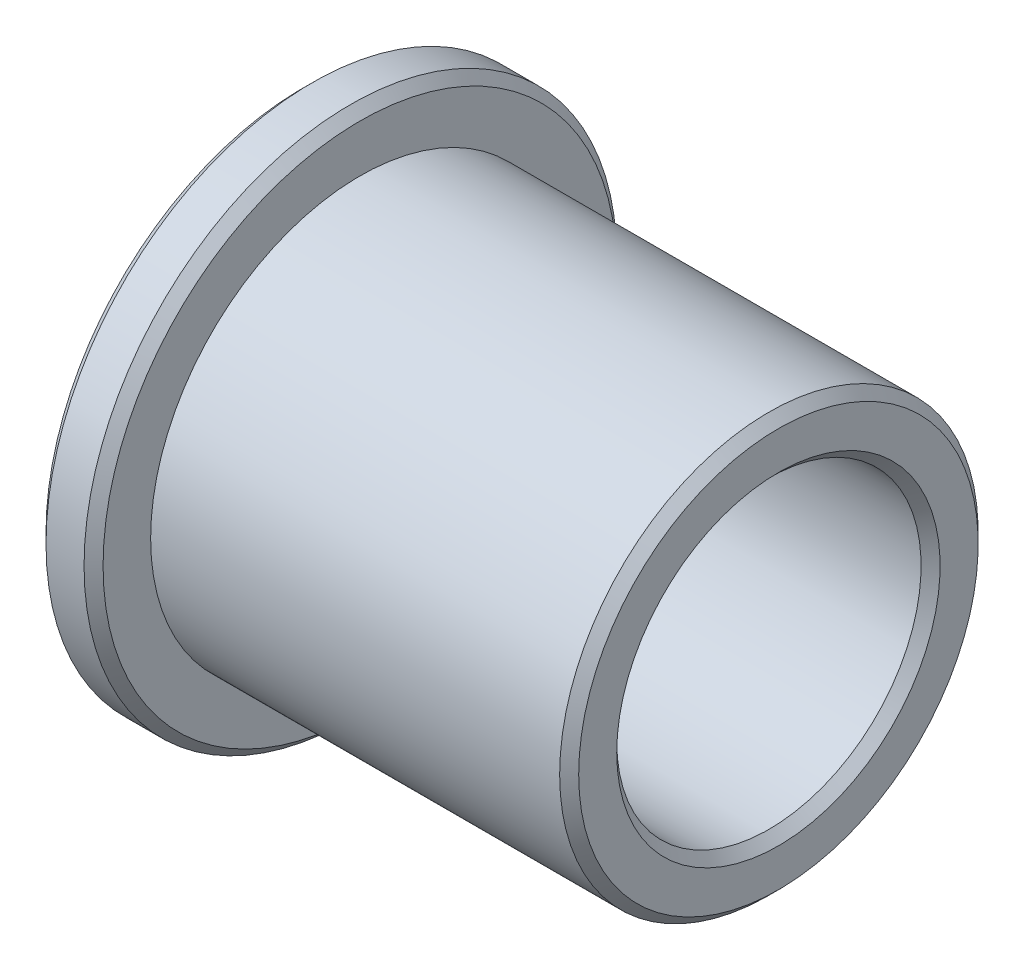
ISO-10303-21;
HEADER;
FILE_DESCRIPTION(('STEP AP214'),'2;1');
FILE_NAME('part.step','',(''),(''),'','','');
FILE_SCHEMA(('AUTOMOTIVE_DESIGN { 1 0 10303 214 1 1 1 1 }'));
ENDSEC;
DATA;
#1=APPLICATION_CONTEXT('core data for automotive mechanical design processes');
#2=APPLICATION_PROTOCOL_DEFINITION('international standard','automotive_design',2000,#1);
#3=PRODUCT_CONTEXT('',#1,'mechanical');
#4=PRODUCT('Part','Part','',(#3));
#5=PRODUCT_RELATED_PRODUCT_CATEGORY('part','',(#4));
#6=PRODUCT_DEFINITION_FORMATION('','',#4);
#7=PRODUCT_DEFINITION_CONTEXT('part definition',#1,'design');
#8=PRODUCT_DEFINITION('design','',#6,#7);
#9=PRODUCT_DEFINITION_SHAPE('','',#8);
#10=(LENGTH_UNIT() NAMED_UNIT(*) SI_UNIT(.MILLI.,.METRE.));
#11=(NAMED_UNIT(*) PLANE_ANGLE_UNIT() SI_UNIT($,.RADIAN.));
#12=(NAMED_UNIT(*) SI_UNIT($,.STERADIAN.) SOLID_ANGLE_UNIT());
#13=UNCERTAINTY_MEASURE_WITH_UNIT(LENGTH_MEASURE(1.E-05),#10,'distance_accuracy_value','');
#14=(GEOMETRIC_REPRESENTATION_CONTEXT(3) GLOBAL_UNCERTAINTY_ASSIGNED_CONTEXT((#13)) GLOBAL_UNIT_ASSIGNED_CONTEXT((#10,
#11,#12)) REPRESENTATION_CONTEXT('',''));
#15=CARTESIAN_POINT('',(0.,0.,0.));
#16=DIRECTION('',(0.,0.,1.));
#17=DIRECTION('',(1.,0.,0.));
#18=AXIS2_PLACEMENT_3D('',#15,#16,#17);
#19=CARTESIAN_POINT('',(-31.662967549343,0.,0.));
#20=DIRECTION('',(-1.,0.,0.));
#21=DIRECTION('',(0.,0.,1.));
#22=AXIS2_PLACEMENT_3D('',#19,#20,#21);
#23=CYLINDRICAL_SURFACE('',#22,11.);
#24=CARTESIAN_POINT('',(3.,0.,0.));
#25=DIRECTION('',(-1.,0.,0.));
#26=DIRECTION('',(0.,0.,1.));
#27=AXIS2_PLACEMENT_3D('',#24,#25,#26);
#28=CIRCLE('',#27,11.);
#29=CARTESIAN_POINT('',(3.,0.,11.));
#30=VERTEX_POINT('',#29);
#31=EDGE_CURVE('E66',#30,#30,#28,.T.);
#32=ORIENTED_EDGE('',*,*,#31,.F.);
#33=EDGE_LOOP('',(#32));
#34=FACE_BOUND('',#33,.T.);
#35=CARTESIAN_POINT('',(24.5,0.,0.));
#36=DIRECTION('',(-1.,0.,0.));
#37=DIRECTION('',(0.,0.,1.));
#38=AXIS2_PLACEMENT_3D('',#35,#36,#37);
#39=CIRCLE('',#38,11.);
#40=CARTESIAN_POINT('',(24.5,0.,11.));
#41=VERTEX_POINT('',#40);
#42=EDGE_CURVE('E10',#41,#41,#39,.T.);
#43=ORIENTED_EDGE('',*,*,#42,.T.);
#44=EDGE_LOOP('',(#43));
#45=FACE_BOUND('',#44,.T.);
#46=ADVANCED_FACE('F29',(#34,#45),#23,.T.);
#47=CARTESIAN_POINT('',(25.,0.,0.));
#48=DIRECTION('',(-1.,0.,0.));
#49=DIRECTION('',(0.,0.,1.));
#50=AXIS2_PLACEMENT_3D('',#47,#48,#49);
#51=CONICAL_SURFACE('',#50,10.5,0.785398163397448);
#52=ORIENTED_EDGE('',*,*,#42,.F.);
#53=EDGE_LOOP('',(#52));
#54=FACE_BOUND('',#53,.T.);
#55=CARTESIAN_POINT('',(25.,0.,0.));
#56=DIRECTION('',(-1.,0.,0.));
#57=DIRECTION('',(0.,0.,1.));
#58=AXIS2_PLACEMENT_3D('',#55,#56,#57);
#59=CIRCLE('',#58,10.5);
#60=CARTESIAN_POINT('',(25.,0.,10.5));
#61=VERTEX_POINT('',#60);
#62=EDGE_CURVE('E35',#61,#61,#59,.T.);
#63=ORIENTED_EDGE('',*,*,#62,.T.);
#64=EDGE_LOOP('',(#63));
#65=FACE_BOUND('',#64,.T.);
#66=ADVANCED_FACE('F73',(#54,#65),#51,.T.);
#67=CARTESIAN_POINT('',(25.0000000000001,10.5,0.));
#68=DIRECTION('',(-1.,0.,0.));
#69=DIRECTION('',(0.,0.,1.));
#70=AXIS2_PLACEMENT_3D('',#67,#68,#69);
#71=PLANE('',#70);
#72=ORIENTED_EDGE('',*,*,#62,.F.);
#73=EDGE_LOOP('',(#72));
#74=FACE_BOUND('',#73,.T.);
#75=CARTESIAN_POINT('',(25.,0.,0.));
#76=DIRECTION('',(-1.,0.,0.));
#77=DIRECTION('',(0.,0.,1.));
#78=AXIS2_PLACEMENT_3D('',#75,#76,#77);
#79=CIRCLE('',#78,8.5);
#80=CARTESIAN_POINT('',(25.,0.,8.5));
#81=VERTEX_POINT('',#80);
#82=EDGE_CURVE('E39',#81,#81,#79,.T.);
#83=ORIENTED_EDGE('',*,*,#82,.T.);
#84=EDGE_LOOP('',(#83));
#85=FACE_BOUND('',#84,.T.);
#86=ADVANCED_FACE('F77',(#74,#85),#71,.F.);
#87=CARTESIAN_POINT('',(24.5,0.,0.));
#88=DIRECTION('',(1.,0.,0.));
#89=DIRECTION('',(0.,0.,-1.));
#90=AXIS2_PLACEMENT_3D('',#87,#88,#89);
#91=CONICAL_SURFACE('',#90,8.,0.785398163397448);
#92=ORIENTED_EDGE('',*,*,#82,.F.);
#93=EDGE_LOOP('',(#92));
#94=FACE_BOUND('',#93,.T.);
#95=CARTESIAN_POINT('',(24.5,0.,0.));
#96=DIRECTION('',(-1.,0.,0.));
#97=DIRECTION('',(0.,0.,1.));
#98=AXIS2_PLACEMENT_3D('',#95,#96,#97);
#99=CIRCLE('',#98,8.);
#100=CARTESIAN_POINT('',(24.5,0.,8.));
#101=VERTEX_POINT('',#100);
#102=EDGE_CURVE('E43',#101,#101,#99,.T.);
#103=ORIENTED_EDGE('',*,*,#102,.T.);
#104=EDGE_LOOP('',(#103));
#105=FACE_BOUND('',#104,.T.);
#106=ADVANCED_FACE('F82',(#94,#105),#91,.F.);
#107=CARTESIAN_POINT('',(-31.662967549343,0.,0.));
#108=DIRECTION('',(-1.,0.,0.));
#109=DIRECTION('',(0.,0.,1.));
#110=AXIS2_PLACEMENT_3D('',#107,#108,#109);
#111=CYLINDRICAL_SURFACE('',#110,8.);
#112=ORIENTED_EDGE('',*,*,#102,.F.);
#113=EDGE_LOOP('',(#112));
#114=FACE_BOUND('',#113,.T.);
#115=CARTESIAN_POINT('',(0.5,0.,0.));
#116=DIRECTION('',(-1.,0.,0.));
#117=DIRECTION('',(0.,0.,1.));
#118=AXIS2_PLACEMENT_3D('',#115,#116,#117);
#119=CIRCLE('',#118,8.);
#120=CARTESIAN_POINT('',(0.5,0.,8.));
#121=VERTEX_POINT('',#120);
#122=EDGE_CURVE('E48',#121,#121,#119,.T.);
#123=ORIENTED_EDGE('',*,*,#122,.T.);
#124=EDGE_LOOP('',(#123));
#125=FACE_BOUND('',#124,.T.);
#126=ADVANCED_FACE('F88',(#114,#125),#111,.F.);
#127=CARTESIAN_POINT('',(0.,0.,0.));
#128=DIRECTION('',(-1.,0.,0.));
#129=DIRECTION('',(0.,0.,1.));
#130=AXIS2_PLACEMENT_3D('',#127,#128,#129);
#131=CONICAL_SURFACE('',#130,8.5,0.785398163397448);
#132=ORIENTED_EDGE('',*,*,#122,.F.);
#133=EDGE_LOOP('',(#132));
#134=FACE_BOUND('',#133,.T.);
#135=CARTESIAN_POINT('',(0.,0.,0.));
#136=DIRECTION('',(-1.,0.,0.));
#137=DIRECTION('',(0.,0.,1.));
#138=AXIS2_PLACEMENT_3D('',#135,#136,#137);
#139=CIRCLE('',#138,8.5);
#140=CARTESIAN_POINT('',(0.,0.,8.5));
#141=VERTEX_POINT('',#140);
#142=EDGE_CURVE('E51',#141,#141,#139,.T.);
#143=ORIENTED_EDGE('',*,*,#142,.T.);
#144=EDGE_LOOP('',(#143));
#145=FACE_BOUND('',#144,.T.);
#146=ADVANCED_FACE('F92',(#134,#145),#131,.F.);
#147=CARTESIAN_POINT('',(0.,8.5,0.));
#148=DIRECTION('',(1.,0.,0.));
#149=DIRECTION('',(0.,0.,-1.));
#150=AXIS2_PLACEMENT_3D('',#147,#148,#149);
#151=PLANE('',#150);
#152=ORIENTED_EDGE('',*,*,#142,.F.);
#153=EDGE_LOOP('',(#152));
#154=FACE_BOUND('',#153,.T.);
#155=CARTESIAN_POINT('',(0.,0.,0.));
#156=DIRECTION('',(-1.,0.,0.));
#157=DIRECTION('',(0.,0.,1.));
#158=AXIS2_PLACEMENT_3D('',#155,#156,#157);
#159=CIRCLE('',#158,13.5);
#160=CARTESIAN_POINT('',(0.,0.,13.5));
#161=VERTEX_POINT('',#160);
#162=EDGE_CURVE('E54',#161,#161,#159,.T.);
#163=ORIENTED_EDGE('',*,*,#162,.T.);
#164=EDGE_LOOP('',(#163));
#165=FACE_BOUND('',#164,.T.);
#166=ADVANCED_FACE('F96',(#154,#165),#151,.F.);
#167=CARTESIAN_POINT('',(0.5,0.,0.));
#168=DIRECTION('',(1.,0.,0.));
#169=DIRECTION('',(0.,0.,-1.));
#170=AXIS2_PLACEMENT_3D('',#167,#168,#169);
#171=CONICAL_SURFACE('',#170,14.,0.785398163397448);
#172=ORIENTED_EDGE('',*,*,#162,.F.);
#173=EDGE_LOOP('',(#172));
#174=FACE_BOUND('',#173,.T.);
#175=CARTESIAN_POINT('',(0.5,0.,0.));
#176=DIRECTION('',(-1.,0.,0.));
#177=DIRECTION('',(0.,0.,1.));
#178=AXIS2_PLACEMENT_3D('',#175,#176,#177);
#179=CIRCLE('',#178,14.);
#180=CARTESIAN_POINT('',(0.5,0.,14.));
#181=VERTEX_POINT('',#180);
#182=EDGE_CURVE('E57',#181,#181,#179,.T.);
#183=ORIENTED_EDGE('',*,*,#182,.T.);
#184=EDGE_LOOP('',(#183));
#185=FACE_BOUND('',#184,.T.);
#186=ADVANCED_FACE('F100',(#174,#185),#171,.T.);
#187=CARTESIAN_POINT('',(-31.662967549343,0.,0.));
#188=DIRECTION('',(-1.,0.,0.));
#189=DIRECTION('',(0.,0.,1.));
#190=AXIS2_PLACEMENT_3D('',#187,#188,#189);
#191=CYLINDRICAL_SURFACE('',#190,14.);
#192=ORIENTED_EDGE('',*,*,#182,.F.);
#193=EDGE_LOOP('',(#192));
#194=FACE_BOUND('',#193,.T.);
#195=CARTESIAN_POINT('',(2.5,0.,0.));
#196=DIRECTION('',(-1.,0.,0.));
#197=DIRECTION('',(0.,0.,1.));
#198=AXIS2_PLACEMENT_3D('',#195,#196,#197);
#199=CIRCLE('',#198,14.);
#200=CARTESIAN_POINT('',(2.5,0.,14.));
#201=VERTEX_POINT('',#200);
#202=EDGE_CURVE('E60',#201,#201,#199,.T.);
#203=ORIENTED_EDGE('',*,*,#202,.T.);
#204=EDGE_LOOP('',(#203));
#205=FACE_BOUND('',#204,.T.);
#206=ADVANCED_FACE('F104',(#194,#205),#191,.T.);
#207=CARTESIAN_POINT('',(3.,0.,0.));
#208=DIRECTION('',(-1.,0.,0.));
#209=DIRECTION('',(0.,0.,1.));
#210=AXIS2_PLACEMENT_3D('',#207,#208,#209);
#211=CONICAL_SURFACE('',#210,13.5,0.785398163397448);
#212=ORIENTED_EDGE('',*,*,#202,.F.);
#213=EDGE_LOOP('',(#212));
#214=FACE_BOUND('',#213,.T.);
#215=CARTESIAN_POINT('',(3.,0.,0.));
#216=DIRECTION('',(-1.,0.,0.));
#217=DIRECTION('',(0.,0.,1.));
#218=AXIS2_PLACEMENT_3D('',#215,#216,#217);
#219=CIRCLE('',#218,13.5);
#220=CARTESIAN_POINT('',(3.,0.,13.5));
#221=VERTEX_POINT('',#220);
#222=EDGE_CURVE('E63',#221,#221,#219,.T.);
#223=ORIENTED_EDGE('',*,*,#222,.T.);
#224=EDGE_LOOP('',(#223));
#225=FACE_BOUND('',#224,.T.);
#226=ADVANCED_FACE('F108',(#214,#225),#211,.T.);
#227=CARTESIAN_POINT('',(3.,13.5,0.));
#228=DIRECTION('',(-1.,0.,0.));
#229=DIRECTION('',(0.,0.,1.));
#230=AXIS2_PLACEMENT_3D('',#227,#228,#229);
#231=PLANE('',#230);
#232=ORIENTED_EDGE('',*,*,#222,.F.);
#233=EDGE_LOOP('',(#232));
#234=FACE_BOUND('',#233,.T.);
#235=ORIENTED_EDGE('',*,*,#31,.T.);
#236=EDGE_LOOP('',(#235));
#237=FACE_BOUND('',#236,.T.);
#238=ADVANCED_FACE('F70',(#234,#237),#231,.F.);
#239=CLOSED_SHELL('',(#46,#66,#86,#106,#126,#146,#166,#186,#206,#226,#238));
#240=MANIFOLD_SOLID_BREP('B2',#239);
#241=ADVANCED_BREP_SHAPE_REPRESENTATION('',(#18,#240),#14);
#242=SHAPE_DEFINITION_REPRESENTATION(#9,#241);
ENDSEC;
END-ISO-10303-21;
